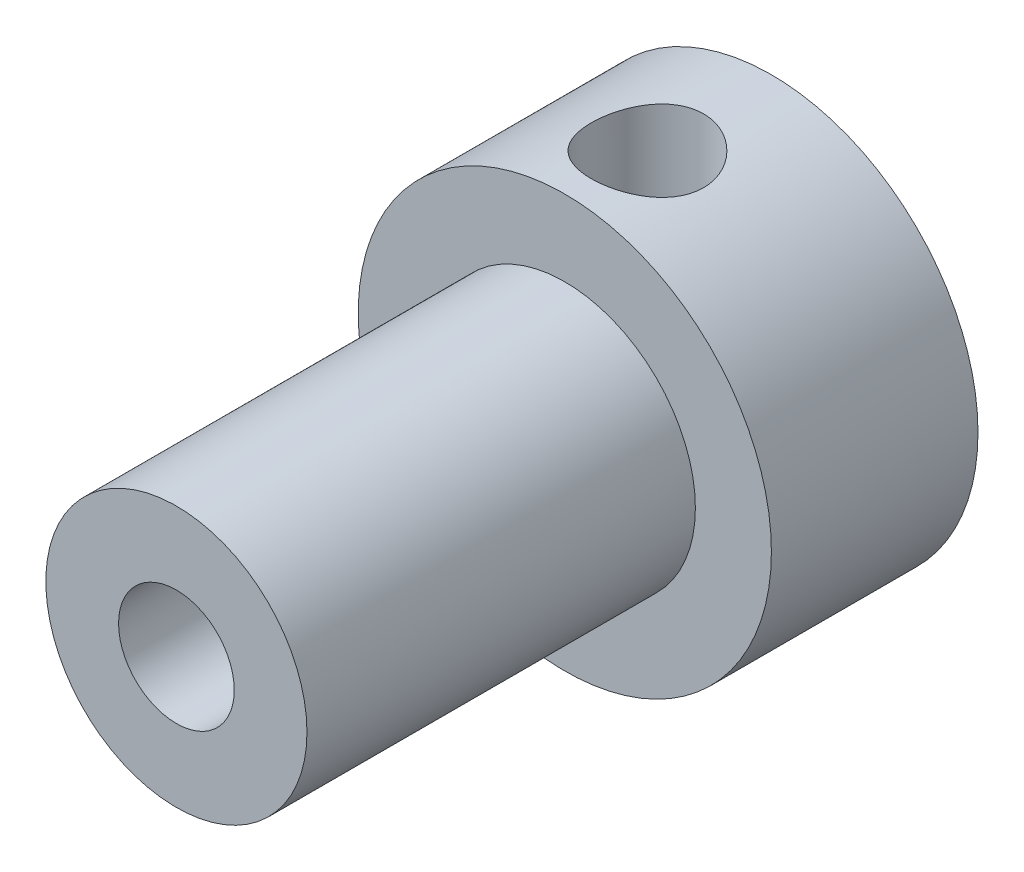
ISO-10303-21;
HEADER;
FILE_DESCRIPTION(('STEP AP214'),'2;1');
FILE_NAME('part.step','',(''),(''),'','','');
FILE_SCHEMA(('AUTOMOTIVE_DESIGN { 1 0 10303 214 1 1 1 1 }'));
ENDSEC;
DATA;
#1=APPLICATION_CONTEXT('core data for automotive mechanical design processes');
#2=APPLICATION_PROTOCOL_DEFINITION('international standard','automotive_design',2000,#1);
#3=PRODUCT_CONTEXT('',#1,'mechanical');
#4=PRODUCT('Part','Part','',(#3));
#5=PRODUCT_RELATED_PRODUCT_CATEGORY('part','',(#4));
#6=PRODUCT_DEFINITION_FORMATION('','',#4);
#7=PRODUCT_DEFINITION_CONTEXT('part definition',#1,'design');
#8=PRODUCT_DEFINITION('design','',#6,#7);
#9=PRODUCT_DEFINITION_SHAPE('','',#8);
#10=(LENGTH_UNIT() NAMED_UNIT(*) SI_UNIT(.MILLI.,.METRE.));
#11=(NAMED_UNIT(*) PLANE_ANGLE_UNIT() SI_UNIT($,.RADIAN.));
#12=(NAMED_UNIT(*) SI_UNIT($,.STERADIAN.) SOLID_ANGLE_UNIT());
#13=UNCERTAINTY_MEASURE_WITH_UNIT(LENGTH_MEASURE(1.E-05),#10,'distance_accuracy_value','');
#14=(GEOMETRIC_REPRESENTATION_CONTEXT(3) GLOBAL_UNCERTAINTY_ASSIGNED_CONTEXT((#13)) GLOBAL_UNIT_ASSIGNED_CONTEXT((#10,
#11,#12)) REPRESENTATION_CONTEXT('',''));
#15=CARTESIAN_POINT('',(0.,0.,0.));
#16=DIRECTION('',(0.,0.,1.));
#17=DIRECTION('',(1.,0.,0.));
#18=AXIS2_PLACEMENT_3D('',#15,#16,#17);
#19=CARTESIAN_POINT('',(0.,0.,18.288));
#20=DIRECTION('',(0.,0.,-1.));
#21=DIRECTION('',(-1.,0.,0.));
#22=AXIS2_PLACEMENT_3D('',#19,#20,#21);
#23=CYLINDRICAL_SURFACE('',#22,1.778);
#24=CARTESIAN_POINT('',(0.,0.,18.288));
#25=DIRECTION('',(0.,0.,1.));
#26=DIRECTION('',(1.,0.,0.));
#27=AXIS2_PLACEMENT_3D('',#24,#25,#26);
#28=CIRCLE('',#27,1.778);
#29=CARTESIAN_POINT('',(1.778,0.,18.288));
#30=VERTEX_POINT('',#29);
#31=EDGE_CURVE('E42',#30,#30,#28,.T.);
#32=ORIENTED_EDGE('',*,*,#31,.T.);
#33=EDGE_LOOP('',(#32));
#34=FACE_BOUND('',#33,.T.);
#35=CARTESIAN_POINT('',(0.,0.,10.668));
#36=DIRECTION('',(0.,0.,-1.));
#37=DIRECTION('',(-1.,0.,0.));
#38=AXIS2_PLACEMENT_3D('',#35,#36,#37);
#39=CIRCLE('',#38,1.778);
#40=CARTESIAN_POINT('',(-1.778,0.,10.668));
#41=VERTEX_POINT('',#40);
#42=EDGE_CURVE('E38',#41,#41,#39,.T.);
#43=ORIENTED_EDGE('',*,*,#42,.T.);
#44=EDGE_LOOP('',(#43));
#45=FACE_BOUND('',#44,.T.);
#46=ADVANCED_FACE('F33',(#34,#45),#23,.F.);
#47=CARTESIAN_POINT('',(0.,0.,18.288));
#48=DIRECTION('',(0.,0.,1.));
#49=DIRECTION('',(1.,0.,0.));
#50=AXIS2_PLACEMENT_3D('',#47,#48,#49);
#51=PLANE('',#50);
#52=ORIENTED_EDGE('',*,*,#31,.F.);
#53=EDGE_LOOP('',(#52));
#54=FACE_BOUND('',#53,.T.);
#55=CARTESIAN_POINT('',(0.,0.,18.288));
#56=DIRECTION('',(0.,0.,1.));
#57=DIRECTION('',(1.,0.,0.));
#58=AXIS2_PLACEMENT_3D('',#55,#56,#57);
#59=CIRCLE('',#58,4.0132);
#60=CARTESIAN_POINT('',(4.0132,0.,18.288));
#61=VERTEX_POINT('',#60);
#62=EDGE_CURVE('E107',#61,#61,#59,.T.);
#63=ORIENTED_EDGE('',*,*,#62,.T.);
#64=EDGE_LOOP('',(#63));
#65=FACE_BOUND('',#64,.T.);
#66=ADVANCED_FACE('F73',(#54,#65),#51,.T.);
#67=CARTESIAN_POINT('',(0.,0.,18.288));
#68=DIRECTION('',(0.,0.,-1.));
#69=DIRECTION('',(-1.,0.,0.));
#70=AXIS2_PLACEMENT_3D('',#67,#68,#69);
#71=CYLINDRICAL_SURFACE('',#70,6.35);
#72=CARTESIAN_POINT('',(0.,6.35,5.53719999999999));
#73=CARTESIAN_POINT('',(-0.0951449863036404,6.34999863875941,5.53719789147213));
#74=CARTESIAN_POINT('',(-0.19031228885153,6.34784064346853,5.52931190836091));
#75=CARTESIAN_POINT('',(-0.37790078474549,6.33944172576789,5.49803504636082));
#76=CARTESIAN_POINT('',(-0.470320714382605,6.33319895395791,5.47463714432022));
#77=CARTESIAN_POINT('',(-0.649679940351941,6.31731876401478,5.41315689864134));
#78=CARTESIAN_POINT('',(-0.736626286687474,6.30768582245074,5.37509391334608));
#79=CARTESIAN_POINT('',(-0.902901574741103,6.28604072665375,5.28543692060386));
#80=CARTESIAN_POINT('',(-0.982229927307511,6.27402838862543,5.23384186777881));
#81=CARTESIAN_POINT('',(-1.13292446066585,6.24859613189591,5.11727611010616));
#82=CARTESIAN_POINT('',(-1.20408142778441,6.23515139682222,5.052040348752));
#83=CARTESIAN_POINT('',(-1.33459195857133,6.20852721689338,4.91061131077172));
#84=CARTESIAN_POINT('',(-1.39394393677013,6.19534780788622,4.8344165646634));
#85=CARTESIAN_POINT('',(-1.50019197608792,6.17049137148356,4.67154726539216));
#86=CARTESIAN_POINT('',(-1.54684512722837,6.1588455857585,4.58470904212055));
#87=CARTESIAN_POINT('',(-1.62480576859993,6.1387407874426,4.40405315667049));
#88=CARTESIAN_POINT('',(-1.6561162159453,6.13028116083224,4.31023684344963));
#89=CARTESIAN_POINT('',(-1.70177180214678,6.11776309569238,4.12061011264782));
#90=CARTESIAN_POINT('',(-1.71649726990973,6.11360617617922,4.02489792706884));
#91=CARTESIAN_POINT('',(-1.72975094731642,6.10987013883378,3.83227835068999));
#92=CARTESIAN_POINT('',(-1.72828231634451,6.11029012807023,3.73537119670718));
#93=CARTESIAN_POINT('',(-1.70949093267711,6.11557244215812,3.54609947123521));
#94=CARTESIAN_POINT('',(-1.69263079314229,6.12030513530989,3.45368477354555));
#95=CARTESIAN_POINT('',(-1.64427691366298,6.13347170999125,3.27304801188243));
#96=CARTESIAN_POINT('',(-1.6127819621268,6.1419058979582,3.1848262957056));
#97=CARTESIAN_POINT('',(-1.53568116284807,6.16163749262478,3.01388536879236));
#98=CARTESIAN_POINT('',(-1.48991501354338,6.1729671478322,2.93124234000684));
#99=CARTESIAN_POINT('',(-1.38568270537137,6.19719605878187,2.77464765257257));
#100=CARTESIAN_POINT('',(-1.32721395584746,6.21009563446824,2.70069777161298));
#101=CARTESIAN_POINT('',(-1.19688110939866,6.23654842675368,2.5609482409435));
#102=CARTESIAN_POINT('',(-1.12462920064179,6.25010895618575,2.49551112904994));
#103=CARTESIAN_POINT('',(-0.970010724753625,6.27596319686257,2.37760646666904));
#104=CARTESIAN_POINT('',(-0.887643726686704,6.28825685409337,2.32513946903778));
#105=CARTESIAN_POINT('',(-0.714556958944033,6.31027294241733,2.23449576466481));
#106=CARTESIAN_POINT('',(-0.623799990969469,6.31998310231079,2.1963869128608));
#107=CARTESIAN_POINT('',(-0.43684259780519,6.3356495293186,2.13607348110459));
#108=CARTESIAN_POINT('',(-0.340643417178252,6.34160665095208,2.11386528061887));
#109=CARTESIAN_POINT('',(-0.14862445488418,6.34896565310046,2.08655800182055));
#110=CARTESIAN_POINT('',(-0.0528796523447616,6.35049865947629,2.08096627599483));
#111=CARTESIAN_POINT('',(0.138180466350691,6.34921487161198,2.08568706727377));
#112=CARTESIAN_POINT('',(0.233495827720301,6.34639854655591,2.09599786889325));
#113=CARTESIAN_POINT('',(0.419217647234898,6.33681743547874,2.13182770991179));
#114=CARTESIAN_POINT('',(0.509681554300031,6.33012455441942,2.15706996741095));
#115=CARTESIAN_POINT('',(0.685080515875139,6.3135514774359,2.22172301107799));
#116=CARTESIAN_POINT('',(0.770014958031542,6.30367092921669,2.26113536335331));
#117=CARTESIAN_POINT('',(0.933842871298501,6.28151367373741,2.35391015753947));
#118=CARTESIAN_POINT('',(1.01257992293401,6.26919265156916,2.40753796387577));
#119=CARTESIAN_POINT('',(1.16010959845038,6.24357763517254,2.52688954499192));
#120=CARTESIAN_POINT('',(1.22890017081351,6.23028344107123,2.59261580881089));
#121=CARTESIAN_POINT('',(1.35667489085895,6.20373464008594,2.73660078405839));
#122=CARTESIAN_POINT('',(1.41531088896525,6.19049271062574,2.81517137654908));
#123=CARTESIAN_POINT('',(1.51857586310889,6.16597557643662,2.98131885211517));
#124=CARTESIAN_POINT('',(1.56320540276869,6.15470029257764,3.06889537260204));
#125=CARTESIAN_POINT('',(1.6368559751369,6.13552375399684,3.25014848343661));
#126=CARTESIAN_POINT('',(1.66596580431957,6.12760335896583,3.34378685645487));
#127=CARTESIAN_POINT('',(1.70795018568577,6.11603543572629,3.5348830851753));
#128=CARTESIAN_POINT('',(1.72082909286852,6.11238676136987,3.6323399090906));
#129=CARTESIAN_POINT('',(1.72972820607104,6.10987385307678,3.82473465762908));
#130=CARTESIAN_POINT('',(1.72630910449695,6.11085048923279,3.91964494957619));
#131=CARTESIAN_POINT('',(1.70401564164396,6.11710404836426,4.10748094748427));
#132=CARTESIAN_POINT('',(1.68514170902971,6.12238085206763,4.20040670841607));
#133=CARTESIAN_POINT('',(1.63280539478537,6.13654353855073,4.38089810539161));
#134=CARTESIAN_POINT('',(1.59946635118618,6.14539886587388,4.46850207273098));
#135=CARTESIAN_POINT('',(1.51924173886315,6.16572049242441,4.63694035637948));
#136=CARTESIAN_POINT('',(1.47235396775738,6.17718721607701,4.71777356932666));
#137=CARTESIAN_POINT('',(1.36468279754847,6.20187674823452,4.87304093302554));
#138=CARTESIAN_POINT('',(1.30351895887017,6.21514247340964,4.94720447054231));
#139=CARTESIAN_POINT('',(1.16974944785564,6.24170076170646,5.0843972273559));
#140=CARTESIAN_POINT('',(1.09714097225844,6.25499333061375,5.14742371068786));
#141=CARTESIAN_POINT('',(0.940569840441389,6.28046587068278,5.26195231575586));
#142=CARTESIAN_POINT('',(0.856388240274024,6.29261402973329,5.31316281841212));
#143=CARTESIAN_POINT('',(0.680282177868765,6.31407641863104,5.40062505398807));
#144=CARTESIAN_POINT('',(0.588362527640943,6.32339239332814,5.4368860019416));
#145=CARTESIAN_POINT('',(0.414040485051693,6.33699456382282,5.4889114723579));
#146=CARTESIAN_POINT('',(0.33236072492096,6.34183536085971,5.50697659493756));
#147=CARTESIAN_POINT('',(0.167126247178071,6.34833850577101,5.53112113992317));
#148=CARTESIAN_POINT('',(0.0835717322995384,6.3500011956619,5.53720185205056));
#149=CARTESIAN_POINT('',(0.,6.35,5.53719999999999));
#150=B_SPLINE_CURVE_WITH_KNOTS('',3,(#72,#73,#74,#75,#76,#77,#78,#79,#80,#81,#82,#83,#84,#85,
#86,#87,#88,#89,#90,#91,#92,#93,#94,#95,#96,#97,#98,#99,#100,#101,#102,#103,#104,#105,#106,#107,
#108,#109,#110,#111,#112,#113,#114,#115,#116,#117,#118,#119,#120,#121,#122,#123,#124,#125,#126,
#127,#128,#129,#130,#131,#132,#133,#134,#135,#136,#137,#138,#139,#140,#141,#142,#143,#144,#145,
#146,#147,#148,#149),.UNSPECIFIED.,.T.,.F.,(4,2,2,2,2,2,2,2,2,2,2,2,2,2,2,2,2,2,2,2,2,2,2,2,2,2,
2,2,2,2,2,2,2,2,2,2,2,2,4),(0.,0.285128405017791,0.570385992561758,0.855268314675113,
1.1401726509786,1.4312364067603,1.72233922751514,2.01867139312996,2.31494642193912,
2.60427934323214,2.89355581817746,3.17441408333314,3.45529560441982,3.73945326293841,
4.02366892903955,4.31754671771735,4.611437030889,4.90669931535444,5.20189434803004,
5.48824548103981,5.77456572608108,6.0557378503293,6.336941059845,6.62381671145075,
6.9107514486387,7.20612995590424,7.50149657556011,7.79515460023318,8.08873381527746,
8.37228753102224,8.655833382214,8.93700765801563,9.2182276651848,9.50803100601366,
9.79790544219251,10.0943104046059,10.3905323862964,10.641005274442,10.8914512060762),.UNSPECIFIED.);
#151=CARTESIAN_POINT('',(0.,6.35,5.53719999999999));
#152=VERTEX_POINT('',#151);
#153=EDGE_CURVE('E102',#152,#152,#150,.T.);
#154=ORIENTED_EDGE('',*,*,#153,.T.);
#155=EDGE_LOOP('',(#154));
#156=FACE_BOUND('',#155,.T.);
#157=CARTESIAN_POINT('',(0.,0.,0.));
#158=DIRECTION('',(0.,0.,1.));
#159=DIRECTION('',(1.,0.,0.));
#160=AXIS2_PLACEMENT_3D('',#157,#158,#159);
#161=CIRCLE('',#160,6.35);
#162=CARTESIAN_POINT('',(6.35,0.,0.));
#163=VERTEX_POINT('',#162);
#164=EDGE_CURVE('E11',#163,#163,#161,.T.);
#165=ORIENTED_EDGE('',*,*,#164,.T.);
#166=EDGE_LOOP('',(#165));
#167=FACE_BOUND('',#166,.T.);
#168=CARTESIAN_POINT('',(0.,0.,6.35));
#169=DIRECTION('',(0.,0.,1.));
#170=DIRECTION('',(1.,0.,0.));
#171=AXIS2_PLACEMENT_3D('',#168,#169,#170);
#172=CIRCLE('',#171,6.35);
#173=CARTESIAN_POINT('',(6.35,0.,6.35));
#174=VERTEX_POINT('',#173);
#175=EDGE_CURVE('E47',#174,#174,#172,.T.);
#176=ORIENTED_EDGE('',*,*,#175,.F.);
#177=EDGE_LOOP('',(#176));
#178=FACE_BOUND('',#177,.T.);
#179=ADVANCED_FACE('F35',(#156,#167,#178),#71,.T.);
#180=CARTESIAN_POINT('',(0.,0.,0.));
#181=DIRECTION('',(0.,0.,1.));
#182=DIRECTION('',(1.,0.,0.));
#183=AXIS2_PLACEMENT_3D('',#180,#181,#182);
#184=PLANE('',#183);
#185=CARTESIAN_POINT('',(0.,0.,0.));
#186=DIRECTION('',(0.,0.,-1.));
#187=DIRECTION('',(-1.,0.,0.));
#188=AXIS2_PLACEMENT_3D('',#185,#186,#187);
#189=CIRCLE('',#188,2.00025);
#190=CARTESIAN_POINT('',(-2.00025,0.,0.));
#191=VERTEX_POINT('',#190);
#192=EDGE_CURVE('E97',#191,#191,#189,.T.);
#193=ORIENTED_EDGE('',*,*,#192,.F.);
#194=EDGE_LOOP('',(#193));
#195=FACE_BOUND('',#194,.T.);
#196=ORIENTED_EDGE('',*,*,#164,.F.);
#197=EDGE_LOOP('',(#196));
#198=FACE_BOUND('',#197,.T.);
#199=ADVANCED_FACE('F84',(#195,#198),#184,.F.);
#200=CARTESIAN_POINT('',(0.,0.,6.35));
#201=DIRECTION('',(0.,0.,1.));
#202=DIRECTION('',(1.,0.,0.));
#203=AXIS2_PLACEMENT_3D('',#200,#201,#202);
#204=PLANE('',#203);
#205=CARTESIAN_POINT('',(0.,0.,6.35));
#206=DIRECTION('',(0.,0.,1.));
#207=DIRECTION('',(1.,0.,0.));
#208=AXIS2_PLACEMENT_3D('',#205,#206,#207);
#209=CIRCLE('',#208,4.0132);
#210=CARTESIAN_POINT('',(4.0132,0.,6.35));
#211=VERTEX_POINT('',#210);
#212=EDGE_CURVE('E108',#211,#211,#209,.T.);
#213=ORIENTED_EDGE('',*,*,#212,.F.);
#214=EDGE_LOOP('',(#213));
#215=FACE_BOUND('',#214,.T.);
#216=ORIENTED_EDGE('',*,*,#175,.T.);
#217=EDGE_LOOP('',(#216));
#218=FACE_BOUND('',#217,.T.);
#219=ADVANCED_FACE('F83',(#215,#218),#204,.T.);
#220=CARTESIAN_POINT('',(0.,0.,6.35));
#221=DIRECTION('',(0.,0.,1.));
#222=DIRECTION('',(1.,0.,0.));
#223=AXIS2_PLACEMENT_3D('',#220,#221,#222);
#224=CYLINDRICAL_SURFACE('',#223,4.0132);
#225=ORIENTED_EDGE('',*,*,#212,.T.);
#226=EDGE_LOOP('',(#225));
#227=FACE_BOUND('',#226,.T.);
#228=ORIENTED_EDGE('',*,*,#62,.F.);
#229=EDGE_LOOP('',(#228));
#230=FACE_BOUND('',#229,.T.);
#231=ADVANCED_FACE('F91',(#227,#230),#224,.T.);
#232=CARTESIAN_POINT('',(0.,6.35,3.81));
#233=DIRECTION('',(0.,1.,0.));
#234=DIRECTION('',(0.,0.,1.));
#235=AXIS2_PLACEMENT_3D('',#232,#233,#234);
#236=CYLINDRICAL_SURFACE('',#235,1.72719999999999);
#237=CARTESIAN_POINT('',(0.,2.00025,5.53719999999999));
#238=CARTESIAN_POINT('',(-0.0811521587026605,2.00024615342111,5.53719608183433));
#239=CARTESIAN_POINT('',(-0.16233395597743,1.99526809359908,5.53143795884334));
#240=CARTESIAN_POINT('',(-0.321975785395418,1.97580787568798,5.50884323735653));
#241=CARTESIAN_POINT('',(-0.400433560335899,1.96131802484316,5.49199767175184));
#242=CARTESIAN_POINT('',(-0.551939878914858,1.92416588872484,5.44852402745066));
#243=CARTESIAN_POINT('',(-0.625018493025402,1.90155398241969,5.42195623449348));
#244=CARTESIAN_POINT('',(-0.76497501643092,1.84970158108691,5.3604475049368));
#245=CARTESIAN_POINT('',(-0.831850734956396,1.8204587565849,5.32550362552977));
#246=CARTESIAN_POINT('',(-0.983051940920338,1.74477036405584,5.23385237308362));
#247=CARTESIAN_POINT('',(-1.0642771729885,1.69602169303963,5.17393156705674));
#248=CARTESIAN_POINT('',(-1.21337343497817,1.59279392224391,5.04321827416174));
#249=CARTESIAN_POINT('',(-1.28120768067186,1.53829965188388,4.97239676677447));
#250=CARTESIAN_POINT('',(-1.40485807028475,1.42633390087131,4.81968400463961));
#251=CARTESIAN_POINT('',(-1.46039337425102,1.36882399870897,4.7375923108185));
#252=CARTESIAN_POINT('',(-1.53310400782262,1.28528850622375,4.60704270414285));
#253=CARTESIAN_POINT('',(-1.55556503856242,1.25791407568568,4.56232030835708));
#254=CARTESIAN_POINT('',(-1.59685224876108,1.20506491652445,4.47017557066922));
#255=CARTESIAN_POINT('',(-1.61568133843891,1.17958867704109,4.42275543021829));
#256=CARTESIAN_POINT('',(-1.6502489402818,1.13075792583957,4.3226710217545));
#257=CARTESIAN_POINT('',(-1.66580264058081,1.10755751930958,4.26986536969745));
#258=CARTESIAN_POINT('',(-1.69209281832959,1.06696273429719,4.16094749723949));
#259=CARTESIAN_POINT('',(-1.70283990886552,1.0495555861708,4.10484287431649));
#260=CARTESIAN_POINT('',(-1.71764456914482,1.02512253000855,3.99810295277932));
#261=CARTESIAN_POINT('',(-1.72244162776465,1.01696409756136,3.94784063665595));
#262=CARTESIAN_POINT('',(-1.72755867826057,1.00825147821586,3.84645011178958));
#263=CARTESIAN_POINT('',(-1.72788370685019,1.00768873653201,3.79532294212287));
#264=CARTESIAN_POINT('',(-1.72403803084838,1.01425008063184,3.6938501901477));
#265=CARTESIAN_POINT('',(-1.71987464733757,1.02136164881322,3.64350347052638));
#266=CARTESIAN_POINT('',(-1.70742710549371,1.04203432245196,3.54466081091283));
#267=CARTESIAN_POINT('',(-1.69913532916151,1.05560734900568,3.49616847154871));
#268=CARTESIAN_POINT('',(-1.67223932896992,1.0979880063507,3.3703445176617));
#269=CARTESIAN_POINT('',(-1.65044121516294,1.13093626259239,3.29512583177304));
#270=CARTESIAN_POINT('',(-1.5983743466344,1.20341542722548,3.15095890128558));
#271=CARTESIAN_POINT('',(-1.56807058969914,1.24297325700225,3.0820381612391));
#272=CARTESIAN_POINT('',(-1.50821353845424,1.31449570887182,2.96643036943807));
#273=CARTESIAN_POINT('',(-1.4803653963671,1.34588729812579,2.91849140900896));
#274=CARTESIAN_POINT('',(-1.42034905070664,1.40908202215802,2.82567942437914));
#275=CARTESIAN_POINT('',(-1.38817878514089,1.44088534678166,2.78080787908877));
#276=CARTESIAN_POINT('',(-1.28527582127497,1.5354835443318,2.65091431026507));
#277=CARTESIAN_POINT('',(-1.20802177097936,1.5976303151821,2.57036439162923));
#278=CARTESIAN_POINT('',(-1.05706701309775,1.69994347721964,2.44137622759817));
#279=CARTESIAN_POINT('',(-0.987076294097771,1.74177856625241,2.38989366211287));
#280=CARTESIAN_POINT('',(-0.837364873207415,1.81847631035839,2.29679867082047));
#281=CARTESIAN_POINT('',(-0.75765989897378,1.8533500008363,2.25517060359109));
#282=CARTESIAN_POINT('',(-0.604257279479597,1.90822158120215,2.19019356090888));
#283=CARTESIAN_POINT('',(-0.531926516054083,1.92975189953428,2.16492452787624));
#284=CARTESIAN_POINT('',(-0.382721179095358,1.9647852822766,2.12396470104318));
#285=CARTESIAN_POINT('',(-0.30584927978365,1.97829302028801,2.10826833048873));
#286=CARTESIAN_POINT('',(-0.14926580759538,1.9962346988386,2.08744346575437));
#287=CARTESIAN_POINT('',(-0.0695431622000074,2.0006281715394,2.08236210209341));
#288=CARTESIAN_POINT('',(0.0897872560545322,1.99982060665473,2.0832972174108));
#289=CARTESIAN_POINT('',(0.169395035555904,1.99462014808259,2.08931302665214));
#290=CARTESIAN_POINT('',(0.320249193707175,1.97580541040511,2.11116090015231));
#291=CARTESIAN_POINT('',(0.391685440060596,1.96282230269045,2.12625685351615));
#292=CARTESIAN_POINT('',(0.530583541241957,1.92991711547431,2.16473439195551));
#293=CARTESIAN_POINT('',(0.598044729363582,1.90999387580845,2.1881173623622));
#294=CARTESIAN_POINT('',(0.733288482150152,1.86248343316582,2.24433408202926));
#295=CARTESIAN_POINT('',(0.800633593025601,1.83439761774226,2.27779084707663));
#296=CARTESIAN_POINT('',(0.928683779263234,1.77301997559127,2.35183446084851));
#297=CARTESIAN_POINT('',(0.989383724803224,1.7397241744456,2.39242675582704));
#298=CARTESIAN_POINT('',(1.13316926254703,1.65143241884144,2.50195246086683));
#299=CARTESIAN_POINT('',(1.21183994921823,1.59404314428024,2.57476737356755));
#300=CARTESIAN_POINT('',(1.35358888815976,1.475578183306,2.73191153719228));
#301=CARTESIAN_POINT('',(1.41663072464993,1.41449429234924,2.81626698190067));
#302=CARTESIAN_POINT('',(1.51436009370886,1.30830566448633,2.97541167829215));
#303=CARTESIAN_POINT('',(1.55223469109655,1.26274712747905,3.04796275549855));
#304=CARTESIAN_POINT('',(1.61815323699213,1.17705631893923,3.20035221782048));
#305=CARTESIAN_POINT('',(1.64622688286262,1.13690788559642,3.28016764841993));
#306=CARTESIAN_POINT('',(1.68210717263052,1.08264900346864,3.4144714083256));
#307=CARTESIAN_POINT('',(1.69352999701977,1.06454387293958,3.46634066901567));
#308=CARTESIAN_POINT('',(1.71167063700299,1.03512488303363,3.57272210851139));
#309=CARTESIAN_POINT('',(1.7184006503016,1.02379342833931,3.62722703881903));
#310=CARTESIAN_POINT('',(1.72662134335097,1.00987910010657,3.73840531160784));
#311=CARTESIAN_POINT('',(1.72805536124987,1.00739085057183,3.79509558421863));
#312=CARTESIAN_POINT('',(1.72534601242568,1.01201975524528,3.90796057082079));
#313=CARTESIAN_POINT('',(1.72119795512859,1.01914498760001,3.96413481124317));
#314=CARTESIAN_POINT('',(1.70658176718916,1.04345737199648,4.08401008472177));
#315=CARTESIAN_POINT('',(1.69511225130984,1.06222196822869,4.14725070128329));
#316=CARTESIAN_POINT('',(1.66611200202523,1.10714930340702,4.26965020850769));
#317=CARTESIAN_POINT('',(1.64855916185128,1.133338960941,4.32879325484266));
#318=CARTESIAN_POINT('',(1.61118323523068,1.1857352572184,4.43446627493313));
#319=CARTESIAN_POINT('',(1.59209225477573,1.21135360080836,4.48155977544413));
#320=CARTESIAN_POINT('',(1.55031043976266,1.26438983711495,4.57307769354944));
#321=CARTESIAN_POINT('',(1.52761720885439,1.2918089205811,4.61750030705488));
#322=CARTESIAN_POINT('',(1.45427375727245,1.37533865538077,4.74711901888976));
#323=CARTESIAN_POINT('',(1.39837932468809,1.43269247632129,4.8286120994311));
#324=CARTESIAN_POINT('',(1.26932558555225,1.54847799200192,4.98598553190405));
#325=CARTESIAN_POINT('',(1.19538488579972,1.60679504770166,5.0613094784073));
#326=CARTESIAN_POINT('',(1.03195954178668,1.71629648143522,5.19911028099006));
#327=CARTESIAN_POINT('',(0.942518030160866,1.76749995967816,5.26162176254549));
#328=CARTESIAN_POINT('',(0.778104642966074,1.84421524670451,5.35395130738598));
#329=CARTESIAN_POINT('',(0.706914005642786,1.872816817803,5.38794229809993));
#330=CARTESIAN_POINT('',(0.558246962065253,1.92236012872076,5.44643900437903));
#331=CARTESIAN_POINT('',(0.480779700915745,1.94331277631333,5.47095823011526));
#332=CARTESIAN_POINT('',(0.336272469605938,1.9728914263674,5.5054592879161));
#333=CARTESIAN_POINT('',(0.269997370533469,1.98309122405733,5.51730388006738));
#334=CARTESIAN_POINT('',(0.135821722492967,1.9967719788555,5.53317571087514));
#335=CARTESIAN_POINT('',(0.0679212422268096,2.0002532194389,5.53720327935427));
#336=CARTESIAN_POINT('',(0.,2.00025,5.53719999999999));
#337=B_SPLINE_CURVE_WITH_KNOTS('',3,(#237,#238,#239,#240,#241,#242,#243,#244,#245,#246,#247,
#248,#249,#250,#251,#252,#253,#254,#255,#256,#257,#258,#259,#260,#261,#262,#263,#264,#265,#266,
#267,#268,#269,#270,#271,#272,#273,#274,#275,#276,#277,#278,#279,#280,#281,#282,#283,#284,#285,
#286,#287,#288,#289,#290,#291,#292,#293,#294,#295,#296,#297,#298,#299,#300,#301,#302,#303,#304,
#305,#306,#307,#308,#309,#310,#311,#312,#313,#314,#315,#316,#317,#318,#319,#320,#321,#322,#323,
#324,#325,#326,#327,#328,#329,#330,#331,#332,#333,#334,#335,#336),.UNSPECIFIED.,.T.,.F.,(4,2,2,
2,2,2,2,2,2,2,2,2,2,2,2,2,2,2,2,2,2,2,2,2,2,2,2,2,2,2,2,2,2,2,2,2,2,2,2,2,2,2,2,2,2,2,2,2,2,4),
(0.,0.243167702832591,0.486532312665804,0.728412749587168,0.970378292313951,1.30482711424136,
1.64018223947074,1.98254698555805,2.15352126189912,2.32435796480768,2.50315221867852,
2.68154971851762,2.83430511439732,2.98688845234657,3.13922328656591,3.29184026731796,
3.54528671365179,3.79979182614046,3.9906921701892,4.18168391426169,4.56270420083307,
4.85100577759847,5.13884663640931,5.37661631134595,5.61424733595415,5.85293121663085,
6.09160069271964,6.31312720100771,6.53469075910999,6.77463162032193,7.0147564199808,
7.37760885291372,7.7412989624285,8.02163965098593,8.30112336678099,8.46896291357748,
8.63636456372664,8.8055521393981,8.97488197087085,9.17462696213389,9.37510557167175,
9.5456021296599,9.71621258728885,10.0576245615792,10.4178420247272,10.7770727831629,
11.0278735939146,11.2783153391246,11.481845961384,11.685367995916),.UNSPECIFIED.);
#338=CARTESIAN_POINT('',(0.,2.00025,5.53719999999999));
#339=VERTEX_POINT('',#338);
#340=EDGE_CURVE('E50',#339,#339,#337,.T.);
#341=ORIENTED_EDGE('',*,*,#340,.T.);
#342=EDGE_LOOP('',(#341));
#343=FACE_BOUND('',#342,.T.);
#344=ORIENTED_EDGE('',*,*,#153,.F.);
#345=EDGE_LOOP('',(#344));
#346=FACE_BOUND('',#345,.T.);
#347=ADVANCED_FACE('F57',(#343,#346),#236,.F.);
#348=CARTESIAN_POINT('',(0.,0.,10.668));
#349=DIRECTION('',(0.,0.,-1.));
#350=DIRECTION('',(-1.,0.,0.));
#351=AXIS2_PLACEMENT_3D('',#348,#349,#350);
#352=CYLINDRICAL_SURFACE('',#351,2.00025);
#353=ORIENTED_EDGE('',*,*,#192,.T.);
#354=EDGE_LOOP('',(#353));
#355=FACE_BOUND('',#354,.T.);
#356=CARTESIAN_POINT('',(0.,0.,10.668));
#357=DIRECTION('',(0.,0.,-1.));
#358=DIRECTION('',(-1.,0.,0.));
#359=AXIS2_PLACEMENT_3D('',#356,#357,#358);
#360=CIRCLE('',#359,2.00025);
#361=CARTESIAN_POINT('',(-2.00025,0.,10.668));
#362=VERTEX_POINT('',#361);
#363=EDGE_CURVE('E56',#362,#362,#360,.T.);
#364=ORIENTED_EDGE('',*,*,#363,.F.);
#365=EDGE_LOOP('',(#364));
#366=FACE_BOUND('',#365,.T.);
#367=ORIENTED_EDGE('',*,*,#340,.F.);
#368=EDGE_LOOP('',(#367));
#369=FACE_BOUND('',#368,.T.);
#370=ADVANCED_FACE('F60',(#355,#366,#369),#352,.F.);
#371=CARTESIAN_POINT('',(0.,0.,10.668));
#372=DIRECTION('',(0.,0.,-1.));
#373=DIRECTION('',(-1.,0.,0.));
#374=AXIS2_PLACEMENT_3D('',#371,#372,#373);
#375=PLANE('',#374);
#376=ORIENTED_EDGE('',*,*,#42,.F.);
#377=EDGE_LOOP('',(#376));
#378=FACE_BOUND('',#377,.T.);
#379=ORIENTED_EDGE('',*,*,#363,.T.);
#380=EDGE_LOOP('',(#379));
#381=FACE_BOUND('',#380,.T.);
#382=ADVANCED_FACE('F64',(#378,#381),#375,.T.);
#383=CLOSED_SHELL('',(#46,#66,#179,#199,#219,#231,#347,#370,#382));
#384=MANIFOLD_SOLID_BREP('B2',#383);
#385=ADVANCED_BREP_SHAPE_REPRESENTATION('',(#18,#384),#14);
#386=SHAPE_DEFINITION_REPRESENTATION(#9,#385);
ENDSEC;
END-ISO-10303-21;
